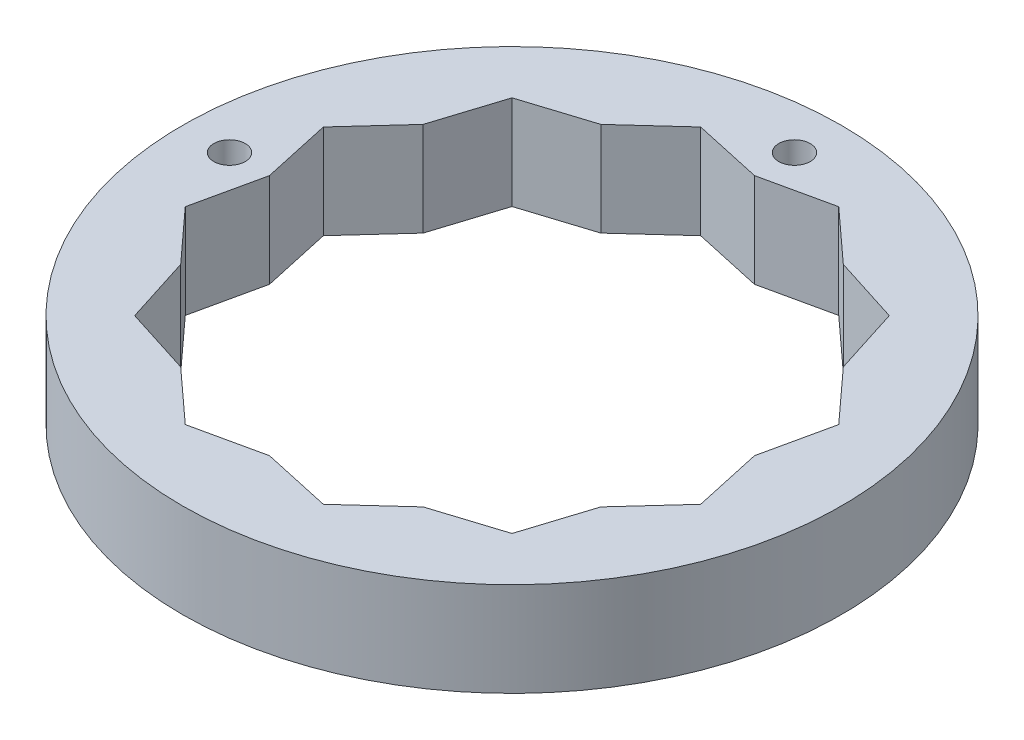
from build123d import *

# Parameters (mm, degrees)
SKETCH1_R           = 10.5
BOSS_EXTRUDE1_DEPTH = 3
CUT_EXTRUDE1_DEPTH  = 3
CUT_EXTRUDE2_REACH  = 17.149
SKETCH3_R           = 0.5


with BuildPart() as part:
    # Sketch1 → Boss-Extrude1 (new body)
    with BuildSketch(Plane(origin=(0, 0, 0), x_dir=(1, 0, 0), z_dir=(0, 1, 0))):
        with Locations(Location((0, 0, 0), (0, 0, 270))):
            Circle(SKETCH1_R)
    extrude(amount=BOSS_EXTRUDE1_DEPTH)

    # Sketch2 → Cut-Extrude1 (cut)
    with BuildSketch(Plane(origin=(0, 0, 0), x_dir=(1, 0, 0), z_dir=(0, 1, 0))):
        Polygon((-2.199961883, 8.210369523), (0, 7.72740661), (2.199961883, 8.210369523), (3.863703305, 6.69213043), (6.01040764, 6.01040764), (6.69213043, 3.863703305), (8.210369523, 2.199961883), (7.72740661, 0), (8.210369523, -2.199961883), (6.69213043, -3.863703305), (6.01040764, -6.01040764), (3.863703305, -6.69213043), (2.199961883, -8.210369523), (0, -7.72740661), (-2.199961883, -8.210369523), (-3.863703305, -6.69213043), (-6.01040764, -6.01040764), (-6.69213043, -3.863703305), (-8.210369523, -2.199961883), (-7.72740661, 0), (-8.210369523, 2.199961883), (-6.69213043, 3.863703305), (-6.01040764, 6.01040764), (-3.863703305, 6.69213043), align=None)
    extrude(amount=CUT_EXTRUDE1_DEPTH, mode=Mode.SUBTRACT)

    # Sketch3 → Cut-Extrude2 (cut, up to next)
    with BuildSketch(Plane(origin=(0, 0, 0), x_dir=(1, 0, 0), z_dir=(0, 1, 0)), mode=Mode.PRIVATE) as cut_extrude2_sk1:
        with Locations(Location((0, 9, 0), (0, 0, 270))):
            Circle(SKETCH3_R)
    cut_extrude2_tool1 = extrude(cut_extrude2_sk1.sketch, amount=CUT_EXTRUDE2_REACH, mode=Mode.PRIVATE) & part.part
    # Sketch3 → Cut-Extrude2 (cut, up to next)
    with BuildSketch(Plane(origin=(0, 0, 0), x_dir=(1, 0, 0), z_dir=(0, 1, 0)), mode=Mode.PRIVATE) as cut_extrude2_sk2:
        with Locations(Location((-9, 0, 0), (0, 0, 270))):
            Circle(SKETCH3_R)
    cut_extrude2_tool2 = extrude(cut_extrude2_sk2.sketch, amount=CUT_EXTRUDE2_REACH, mode=Mode.PRIVATE) & part.part
    add(cut_extrude2_tool1.solids().sort_by_distance((0, 0, -9))[0], mode=Mode.SUBTRACT)
    add(cut_extrude2_tool2.solids().sort_by_distance((-9, 0, 0))[0], mode=Mode.SUBTRACT)


solid = part.part
